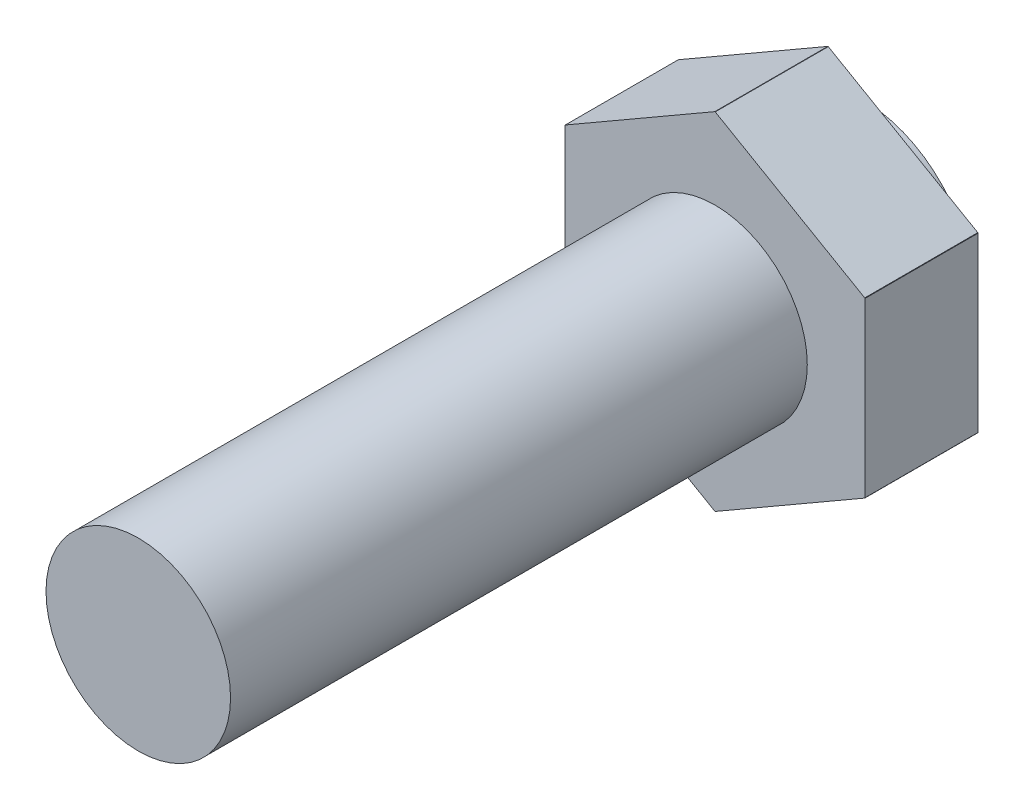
ISO-10303-21;
HEADER;
FILE_DESCRIPTION(('STEP AP214'),'2;1');
FILE_NAME('part.step','',(''),(''),'','','');
FILE_SCHEMA(('AUTOMOTIVE_DESIGN { 1 0 10303 214 1 1 1 1 }'));
ENDSEC;
DATA;
#1=APPLICATION_CONTEXT('core data for automotive mechanical design processes');
#2=APPLICATION_PROTOCOL_DEFINITION('international standard','automotive_design',2000,#1);
#3=PRODUCT_CONTEXT('',#1,'mechanical');
#4=PRODUCT('Part','Part','',(#3));
#5=PRODUCT_RELATED_PRODUCT_CATEGORY('part','',(#4));
#6=PRODUCT_DEFINITION_FORMATION('','',#4);
#7=PRODUCT_DEFINITION_CONTEXT('part definition',#1,'design');
#8=PRODUCT_DEFINITION('design','',#6,#7);
#9=PRODUCT_DEFINITION_SHAPE('','',#8);
#10=(LENGTH_UNIT() NAMED_UNIT(*) SI_UNIT(.MILLI.,.METRE.));
#11=(NAMED_UNIT(*) PLANE_ANGLE_UNIT() SI_UNIT($,.RADIAN.));
#12=(NAMED_UNIT(*) SI_UNIT($,.STERADIAN.) SOLID_ANGLE_UNIT());
#13=UNCERTAINTY_MEASURE_WITH_UNIT(LENGTH_MEASURE(1.E-05),#10,'distance_accuracy_value','');
#14=(GEOMETRIC_REPRESENTATION_CONTEXT(3) GLOBAL_UNCERTAINTY_ASSIGNED_CONTEXT((#13)) GLOBAL_UNIT_ASSIGNED_CONTEXT((#10,
#11,#12)) REPRESENTATION_CONTEXT('',''));
#15=CARTESIAN_POINT('',(0.,0.,0.));
#16=DIRECTION('',(0.,0.,1.));
#17=DIRECTION('',(1.,0.,0.));
#18=AXIS2_PLACEMENT_3D('',#15,#16,#17);
#19=CARTESIAN_POINT('',(-4.,0.,6.4));
#20=DIRECTION('',(0.,0.,-1.));
#21=DIRECTION('',(-1.,0.,0.));
#22=AXIS2_PLACEMENT_3D('',#19,#20,#21);
#23=PLANE('',#22);
#24=CARTESIAN_POINT('',(0.,0.,6.4));
#25=DIRECTION('',(0.,0.,-1.));
#26=DIRECTION('',(-1.,0.,0.));
#27=AXIS2_PLACEMENT_3D('',#24,#25,#26);
#28=CIRCLE('',#27,4.);
#29=CARTESIAN_POINT('',(-4.,0.,6.4));
#30=VERTEX_POINT('',#29);
#31=EDGE_CURVE('E130',#30,#30,#28,.T.);
#32=ORIENTED_EDGE('',*,*,#31,.T.);
#33=EDGE_LOOP('',(#32));
#34=FACE_BOUND('',#33,.T.);
#35=CARTESIAN_POINT('',(0.,0.,6.4));
#36=DIRECTION('',(0.,0.,-1.));
#37=DIRECTION('',(-1.,0.,0.));
#38=AXIS2_PLACEMENT_3D('',#35,#36,#37);
#39=CIRCLE('',#38,7.5);
#40=CARTESIAN_POINT('',(-0.00962965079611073,7.49999381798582,6.4));
#41=VERTEX_POINT('',#40);
#42=CARTESIAN_POINT('',(0.00962965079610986,7.49999381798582,6.4));
#43=VERTEX_POINT('',#42);
#44=EDGE_CURVE('E131',#41,#43,#39,.T.);
#45=ORIENTED_EDGE('',*,*,#44,.F.);
#46=DIRECTION('',(-0.866025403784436,-0.5,0.));
#47=VECTOR('',#46,1.);
#48=CARTESIAN_POINT('',(-6.25,3.89711431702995,6.4));
#49=LINE('',#48,#47);
#50=CARTESIAN_POINT('',(-6.49037034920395,3.75833643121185,6.4));
#51=VERTEX_POINT('',#50);
#52=EDGE_CURVE('E115',#41,#51,#49,.T.);
#53=ORIENTED_EDGE('',*,*,#52,.T.);
#54=CARTESIAN_POINT('',(-6.5,3.74165738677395,6.4));
#55=VERTEX_POINT('',#54);
#56=EDGE_CURVE('E127',#55,#51,#39,.T.);
#57=ORIENTED_EDGE('',*,*,#56,.F.);
#58=DIRECTION('',(0.,-1.,0.));
#59=VECTOR('',#58,1.);
#60=CARTESIAN_POINT('',(-6.5,0.,6.4));
#61=LINE('',#60,#59);
#62=CARTESIAN_POINT('',(-6.5,-3.74165738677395,6.4));
#63=VERTEX_POINT('',#62);
#64=EDGE_CURVE('E121',#55,#63,#61,.T.);
#65=ORIENTED_EDGE('',*,*,#64,.T.);
#66=CARTESIAN_POINT('',(-6.49037034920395,-3.75833643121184,6.4));
#67=VERTEX_POINT('',#66);
#68=EDGE_CURVE('E126',#67,#63,#39,.T.);
#69=ORIENTED_EDGE('',*,*,#68,.F.);
#70=DIRECTION('',(-0.866025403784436,0.5,0.));
#71=VECTOR('',#70,1.);
#72=CARTESIAN_POINT('',(-6.25,-3.89711431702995,6.4));
#73=LINE('',#72,#71);
#74=CARTESIAN_POINT('',(-0.00962965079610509,-7.49999381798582,6.4));
#75=VERTEX_POINT('',#74);
#76=EDGE_CURVE('E247',#75,#67,#73,.T.);
#77=ORIENTED_EDGE('',*,*,#76,.F.);
#78=CARTESIAN_POINT('',(0.00962965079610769,-7.49999381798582,6.4));
#79=VERTEX_POINT('',#78);
#80=EDGE_CURVE('E262',#79,#75,#39,.T.);
#81=ORIENTED_EDGE('',*,*,#80,.F.);
#82=DIRECTION('',(0.866025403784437,0.5,0.));
#83=VECTOR('',#82,1.);
#84=CARTESIAN_POINT('',(0.250000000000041,-7.36121593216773,6.4));
#85=LINE('',#84,#83);
#86=CARTESIAN_POINT('',(6.49037034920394,-3.75833643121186,6.4));
#87=VERTEX_POINT('',#86);
#88=EDGE_CURVE('E239',#79,#87,#85,.T.);
#89=ORIENTED_EDGE('',*,*,#88,.T.);
#90=CARTESIAN_POINT('',(6.5,-3.74165738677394,6.4));
#91=VERTEX_POINT('',#90);
#92=EDGE_CURVE('E264',#91,#87,#39,.T.);
#93=ORIENTED_EDGE('',*,*,#92,.F.);
#94=DIRECTION('',(0.,-1.,0.));
#95=VECTOR('',#94,1.);
#96=CARTESIAN_POINT('',(6.5,0.,6.4));
#97=LINE('',#96,#95);
#98=CARTESIAN_POINT('',(6.5,3.74165738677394,6.4));
#99=VERTEX_POINT('',#98);
#100=EDGE_CURVE('E232',#99,#91,#97,.T.);
#101=ORIENTED_EDGE('',*,*,#100,.F.);
#102=CARTESIAN_POINT('',(6.49037034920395,3.75833643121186,6.4));
#103=VERTEX_POINT('',#102);
#104=EDGE_CURVE('E269',#103,#99,#39,.T.);
#105=ORIENTED_EDGE('',*,*,#104,.F.);
#106=DIRECTION('',(0.866025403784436,-0.5,0.));
#107=VECTOR('',#106,1.);
#108=CARTESIAN_POINT('',(0.250000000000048,7.36121593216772,6.4));
#109=LINE('',#108,#107);
#110=EDGE_CURVE('E225',#43,#103,#109,.T.);
#111=ORIENTED_EDGE('',*,*,#110,.F.);
#112=EDGE_LOOP('',(#45,#53,#57,#65,#69,#77,#81,#89,#93,#101,#105,#111));
#113=FACE_BOUND('',#112,.T.);
#114=ADVANCED_FACE('F14',(#34,#113),#23,.F.);
#115=CARTESIAN_POINT('',(0.,0.,-38.6));
#116=DIRECTION('',(0.,0.,-1.));
#117=DIRECTION('',(-1.,0.,0.));
#118=AXIS2_PLACEMENT_3D('',#115,#116,#117);
#119=CYLINDRICAL_SURFACE('',#118,7.5);
#120=DIRECTION('',(0.,0.,-1.));
#121=VECTOR('',#120,1.);
#122=CARTESIAN_POINT('',(-6.49037034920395,3.75833643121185,-38.6));
#123=LINE('',#122,#121);
#124=CARTESIAN_POINT('',(-6.49037034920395,3.75833643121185,1.5));
#125=VERTEX_POINT('',#124);
#126=EDGE_CURVE('E36',#51,#125,#123,.T.);
#127=ORIENTED_EDGE('',*,*,#126,.T.);
#128=CARTESIAN_POINT('',(0.,0.,1.5));
#129=DIRECTION('',(0.,0.,1.));
#130=DIRECTION('',(1.,0.,0.));
#131=AXIS2_PLACEMENT_3D('',#128,#129,#130);
#132=CIRCLE('',#131,7.5);
#133=CARTESIAN_POINT('',(-6.5,3.74165738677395,1.5));
#134=VERTEX_POINT('',#133);
#135=EDGE_CURVE('E30',#125,#134,#132,.T.);
#136=ORIENTED_EDGE('',*,*,#135,.T.);
#137=DIRECTION('',(0.,0.,-1.));
#138=VECTOR('',#137,1.);
#139=CARTESIAN_POINT('',(-6.5,3.74165738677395,-38.6));
#140=LINE('',#139,#138);
#141=EDGE_CURVE('E252',#134,#55,#140,.F.);
#142=ORIENTED_EDGE('',*,*,#141,.T.);
#143=ORIENTED_EDGE('',*,*,#56,.T.);
#144=EDGE_LOOP('',(#127,#136,#142,#143));
#145=FACE_BOUND('',#144,.T.);
#146=ADVANCED_FACE('F151',(#145),#119,.T.);
#147=DIRECTION('',(0.,0.,-1.));
#148=VECTOR('',#147,1.);
#149=CARTESIAN_POINT('',(-6.5,-3.74165738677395,-38.6));
#150=LINE('',#149,#148);
#151=CARTESIAN_POINT('',(-6.5,-3.74165738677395,1.5));
#152=VERTEX_POINT('',#151);
#153=EDGE_CURVE('E117',#63,#152,#150,.T.);
#154=ORIENTED_EDGE('',*,*,#153,.T.);
#155=CARTESIAN_POINT('',(0.,0.,1.5));
#156=DIRECTION('',(0.,0.,1.));
#157=DIRECTION('',(1.,0.,0.));
#158=AXIS2_PLACEMENT_3D('',#155,#156,#157);
#159=CIRCLE('',#158,7.5);
#160=CARTESIAN_POINT('',(-6.49037034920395,-3.75833643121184,1.5));
#161=VERTEX_POINT('',#160);
#162=EDGE_CURVE('E208',#152,#161,#159,.T.);
#163=ORIENTED_EDGE('',*,*,#162,.T.);
#164=DIRECTION('',(0.,0.,-1.));
#165=VECTOR('',#164,1.);
#166=CARTESIAN_POINT('',(-6.49037034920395,-3.75833643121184,-38.6));
#167=LINE('',#166,#165);
#168=EDGE_CURVE('E249',#67,#161,#167,.T.);
#169=ORIENTED_EDGE('',*,*,#168,.F.);
#170=ORIENTED_EDGE('',*,*,#68,.T.);
#171=EDGE_LOOP('',(#154,#163,#169,#170));
#172=FACE_BOUND('',#171,.T.);
#173=ADVANCED_FACE('F158',(#172),#119,.T.);
#174=DIRECTION('',(0.,0.,-1.));
#175=VECTOR('',#174,1.);
#176=CARTESIAN_POINT('',(0.00962965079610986,7.49999381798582,-38.6));
#177=LINE('',#176,#175);
#178=CARTESIAN_POINT('',(0.00962965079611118,7.49999381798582,1.5));
#179=VERTEX_POINT('',#178);
#180=EDGE_CURVE('E111',#179,#43,#177,.F.);
#181=ORIENTED_EDGE('',*,*,#180,.F.);
#182=CARTESIAN_POINT('',(0.,0.,1.5));
#183=DIRECTION('',(0.,0.,1.));
#184=DIRECTION('',(1.,0.,0.));
#185=AXIS2_PLACEMENT_3D('',#182,#183,#184);
#186=CIRCLE('',#185,7.5);
#187=CARTESIAN_POINT('',(-0.00962965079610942,7.49999381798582,1.5));
#188=VERTEX_POINT('',#187);
#189=EDGE_CURVE('E103',#179,#188,#186,.T.);
#190=ORIENTED_EDGE('',*,*,#189,.T.);
#191=DIRECTION('',(0.,0.,-1.));
#192=VECTOR('',#191,1.);
#193=CARTESIAN_POINT('',(-0.00962965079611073,7.49999381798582,-38.6));
#194=LINE('',#193,#192);
#195=EDGE_CURVE('E110',#188,#41,#194,.F.);
#196=ORIENTED_EDGE('',*,*,#195,.T.);
#197=ORIENTED_EDGE('',*,*,#44,.T.);
#198=EDGE_LOOP('',(#181,#190,#196,#197));
#199=FACE_BOUND('',#198,.T.);
#200=ADVANCED_FACE('F108',(#199),#119,.T.);
#201=DIRECTION('',(0.,0.,-1.));
#202=VECTOR('',#201,1.);
#203=CARTESIAN_POINT('',(-0.00962965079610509,-7.49999381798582,-38.6));
#204=LINE('',#203,#202);
#205=CARTESIAN_POINT('',(-0.00962965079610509,-7.49999381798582,1.5));
#206=VERTEX_POINT('',#205);
#207=EDGE_CURVE('E245',#206,#75,#204,.F.);
#208=ORIENTED_EDGE('',*,*,#207,.F.);
#209=CARTESIAN_POINT('',(0.,0.,1.5));
#210=DIRECTION('',(0.,0.,1.));
#211=DIRECTION('',(1.,0.,0.));
#212=AXIS2_PLACEMENT_3D('',#209,#210,#211);
#213=CIRCLE('',#212,7.5);
#214=CARTESIAN_POINT('',(0.00962965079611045,-7.49999381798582,1.5));
#215=VERTEX_POINT('',#214);
#216=EDGE_CURVE('E218',#206,#215,#213,.T.);
#217=ORIENTED_EDGE('',*,*,#216,.T.);
#218=DIRECTION('',(0.,0.,-1.));
#219=VECTOR('',#218,1.);
#220=CARTESIAN_POINT('',(0.00962965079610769,-7.49999381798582,-38.6));
#221=LINE('',#220,#219);
#222=EDGE_CURVE('E237',#215,#79,#221,.F.);
#223=ORIENTED_EDGE('',*,*,#222,.T.);
#224=ORIENTED_EDGE('',*,*,#80,.T.);
#225=EDGE_LOOP('',(#208,#217,#223,#224));
#226=FACE_BOUND('',#225,.T.);
#227=ADVANCED_FACE('F283',(#226),#119,.T.);
#228=DIRECTION('',(0.,0.,-1.));
#229=VECTOR('',#228,1.);
#230=CARTESIAN_POINT('',(6.49037034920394,-3.75833643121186,-38.6));
#231=LINE('',#230,#229);
#232=CARTESIAN_POINT('',(6.49037034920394,-3.75833643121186,1.5));
#233=VERTEX_POINT('',#232);
#234=EDGE_CURVE('E242',#87,#233,#231,.T.);
#235=ORIENTED_EDGE('',*,*,#234,.T.);
#236=CARTESIAN_POINT('',(0.,0.,1.5));
#237=DIRECTION('',(0.,0.,1.));
#238=DIRECTION('',(1.,0.,0.));
#239=AXIS2_PLACEMENT_3D('',#236,#237,#238);
#240=CIRCLE('',#239,7.5);
#241=CARTESIAN_POINT('',(6.5,-3.74165738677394,1.5));
#242=VERTEX_POINT('',#241);
#243=EDGE_CURVE('E215',#233,#242,#240,.T.);
#244=ORIENTED_EDGE('',*,*,#243,.T.);
#245=DIRECTION('',(0.,0.,-1.));
#246=VECTOR('',#245,1.);
#247=CARTESIAN_POINT('',(6.5,-3.74165738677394,-38.6));
#248=LINE('',#247,#246);
#249=EDGE_CURVE('E234',#91,#242,#248,.T.);
#250=ORIENTED_EDGE('',*,*,#249,.F.);
#251=ORIENTED_EDGE('',*,*,#92,.T.);
#252=EDGE_LOOP('',(#235,#244,#250,#251));
#253=FACE_BOUND('',#252,.T.);
#254=ADVANCED_FACE('F148',(#253),#119,.T.);
#255=DIRECTION('',(0.,0.,-1.));
#256=VECTOR('',#255,1.);
#257=CARTESIAN_POINT('',(6.5,3.74165738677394,-38.6));
#258=LINE('',#257,#256);
#259=CARTESIAN_POINT('',(6.5,3.74165738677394,1.5));
#260=VERTEX_POINT('',#259);
#261=EDGE_CURVE('E230',#260,#99,#258,.F.);
#262=ORIENTED_EDGE('',*,*,#261,.F.);
#263=CARTESIAN_POINT('',(0.,0.,1.5));
#264=DIRECTION('',(0.,0.,1.));
#265=DIRECTION('',(1.,0.,0.));
#266=AXIS2_PLACEMENT_3D('',#263,#264,#265);
#267=CIRCLE('',#266,7.5);
#268=CARTESIAN_POINT('',(6.49037034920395,3.75833643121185,1.5));
#269=VERTEX_POINT('',#268);
#270=EDGE_CURVE('E205',#260,#269,#267,.T.);
#271=ORIENTED_EDGE('',*,*,#270,.T.);
#272=DIRECTION('',(0.,0.,-1.));
#273=VECTOR('',#272,1.);
#274=CARTESIAN_POINT('',(6.49037034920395,3.75833643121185,-38.6));
#275=LINE('',#274,#273);
#276=EDGE_CURVE('E227',#103,#269,#275,.T.);
#277=ORIENTED_EDGE('',*,*,#276,.F.);
#278=ORIENTED_EDGE('',*,*,#104,.T.);
#279=EDGE_LOOP('',(#262,#271,#277,#278));
#280=FACE_BOUND('',#279,.T.);
#281=ADVANCED_FACE('F140',(#280),#119,.T.);
#282=CARTESIAN_POINT('',(0.,0.,31.4));
#283=DIRECTION('',(0.,0.,-1.));
#284=DIRECTION('',(-1.,0.,0.));
#285=AXIS2_PLACEMENT_3D('',#282,#283,#284);
#286=PLANE('',#285);
#287=CARTESIAN_POINT('',(0.,0.,31.4));
#288=DIRECTION('',(0.,0.,-1.));
#289=DIRECTION('',(-1.,0.,0.));
#290=AXIS2_PLACEMENT_3D('',#287,#288,#289);
#291=CIRCLE('',#290,4.);
#292=CARTESIAN_POINT('',(-4.,0.,31.4));
#293=VERTEX_POINT('',#292);
#294=EDGE_CURVE('E23',#293,#293,#291,.T.);
#295=ORIENTED_EDGE('',*,*,#294,.F.);
#296=EDGE_LOOP('',(#295));
#297=FACE_BOUND('',#296,.T.);
#298=ADVANCED_FACE('F16',(#297),#286,.F.);
#299=CARTESIAN_POINT('',(0.,0.,-38.6));
#300=DIRECTION('',(0.,0.,-1.));
#301=DIRECTION('',(-1.,0.,0.));
#302=AXIS2_PLACEMENT_3D('',#299,#300,#301);
#303=CYLINDRICAL_SURFACE('',#302,4.);
#304=ORIENTED_EDGE('',*,*,#31,.F.);
#305=EDGE_LOOP('',(#304));
#306=FACE_BOUND('',#305,.T.);
#307=ORIENTED_EDGE('',*,*,#294,.T.);
#308=EDGE_LOOP('',(#307));
#309=FACE_BOUND('',#308,.T.);
#310=ADVANCED_FACE('F137',(#306,#309),#303,.T.);
#311=CARTESIAN_POINT('',(0.,7.50555349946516,10.));
#312=DIRECTION('',(0.5,0.866025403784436,0.));
#313=DIRECTION('',(0.866025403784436,-0.5,0.));
#314=AXIS2_PLACEMENT_3D('',#311,#312,#313);
#315=PLANE('',#314);
#316=DIRECTION('',(0.866025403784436,-0.5,0.));
#317=VECTOR('',#316,1.);
#318=CARTESIAN_POINT('',(0.,7.50555349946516,1.5));
#319=LINE('',#318,#317);
#320=EDGE_CURVE('E203',#179,#269,#319,.T.);
#321=ORIENTED_EDGE('',*,*,#320,.F.);
#322=ORIENTED_EDGE('',*,*,#180,.T.);
#323=ORIENTED_EDGE('',*,*,#110,.T.);
#324=ORIENTED_EDGE('',*,*,#276,.T.);
#325=EDGE_LOOP('',(#321,#322,#323,#324));
#326=FACE_BOUND('',#325,.T.);
#327=ADVANCED_FACE('F146',(#326),#315,.T.);
#328=CARTESIAN_POINT('',(6.5,3.75277674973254,10.));
#329=DIRECTION('',(1.,0.,0.));
#330=DIRECTION('',(0.,0.,-1.));
#331=AXIS2_PLACEMENT_3D('',#328,#329,#330);
#332=PLANE('',#331);
#333=DIRECTION('',(0.,-1.,0.));
#334=VECTOR('',#333,1.);
#335=CARTESIAN_POINT('',(6.5,3.75277674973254,1.5));
#336=LINE('',#335,#334);
#337=EDGE_CURVE('E213',#260,#242,#336,.T.);
#338=ORIENTED_EDGE('',*,*,#337,.F.);
#339=ORIENTED_EDGE('',*,*,#261,.T.);
#340=ORIENTED_EDGE('',*,*,#100,.T.);
#341=ORIENTED_EDGE('',*,*,#249,.T.);
#342=EDGE_LOOP('',(#338,#339,#340,#341));
#343=FACE_BOUND('',#342,.T.);
#344=ADVANCED_FACE('F177',(#343),#332,.T.);
#345=CARTESIAN_POINT('',(0.,-7.50555349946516,10.));
#346=DIRECTION('',(-0.5,0.866025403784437,0.));
#347=DIRECTION('',(0.866025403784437,0.5,0.));
#348=AXIS2_PLACEMENT_3D('',#345,#346,#347);
#349=PLANE('',#348);
#350=ORIENTED_EDGE('',*,*,#222,.F.);
#351=DIRECTION('',(0.866025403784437,0.5,0.));
#352=VECTOR('',#351,1.);
#353=CARTESIAN_POINT('',(0.,-7.50555349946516,1.5));
#354=LINE('',#353,#352);
#355=EDGE_CURVE('E221',#215,#233,#354,.T.);
#356=ORIENTED_EDGE('',*,*,#355,.T.);
#357=ORIENTED_EDGE('',*,*,#234,.F.);
#358=ORIENTED_EDGE('',*,*,#88,.F.);
#359=EDGE_LOOP('',(#350,#356,#357,#358));
#360=FACE_BOUND('',#359,.T.);
#361=ADVANCED_FACE('F173',(#360),#349,.F.);
#362=CARTESIAN_POINT('',(0.,-7.50555349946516,10.));
#363=DIRECTION('',(-0.5,-0.866025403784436,0.));
#364=DIRECTION('',(-0.866025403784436,0.5,0.));
#365=AXIS2_PLACEMENT_3D('',#362,#363,#364);
#366=PLANE('',#365);
#367=DIRECTION('',(-0.866025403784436,0.5,0.));
#368=VECTOR('',#367,1.);
#369=CARTESIAN_POINT('',(0.,-7.50555349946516,1.5));
#370=LINE('',#369,#368);
#371=EDGE_CURVE('E211',#206,#161,#370,.T.);
#372=ORIENTED_EDGE('',*,*,#371,.F.);
#373=ORIENTED_EDGE('',*,*,#207,.T.);
#374=ORIENTED_EDGE('',*,*,#76,.T.);
#375=ORIENTED_EDGE('',*,*,#168,.T.);
#376=EDGE_LOOP('',(#372,#373,#374,#375));
#377=FACE_BOUND('',#376,.T.);
#378=ADVANCED_FACE('F169',(#377),#366,.T.);
#379=CARTESIAN_POINT('',(-6.5,3.75277674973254,10.));
#380=DIRECTION('',(1.,0.,0.));
#381=DIRECTION('',(0.,-1.,0.));
#382=AXIS2_PLACEMENT_3D('',#379,#380,#381);
#383=PLANE('',#382);
#384=ORIENTED_EDGE('',*,*,#141,.F.);
#385=DIRECTION('',(0.,-1.,0.));
#386=VECTOR('',#385,1.);
#387=CARTESIAN_POINT('',(-6.5,3.75277674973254,1.5));
#388=LINE('',#387,#386);
#389=EDGE_CURVE('E200',#134,#152,#388,.T.);
#390=ORIENTED_EDGE('',*,*,#389,.T.);
#391=ORIENTED_EDGE('',*,*,#153,.F.);
#392=ORIENTED_EDGE('',*,*,#64,.F.);
#393=EDGE_LOOP('',(#384,#390,#391,#392));
#394=FACE_BOUND('',#393,.T.);
#395=ADVANCED_FACE('F166',(#394),#383,.F.);
#396=CARTESIAN_POINT('',(0.,7.50555349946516,10.));
#397=DIRECTION('',(0.5,-0.866025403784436,0.));
#398=DIRECTION('',(-0.866025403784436,-0.5,0.));
#399=AXIS2_PLACEMENT_3D('',#396,#397,#398);
#400=PLANE('',#399);
#401=ORIENTED_EDGE('',*,*,#195,.F.);
#402=DIRECTION('',(-0.866025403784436,-0.5,0.));
#403=VECTOR('',#402,1.);
#404=CARTESIAN_POINT('',(0.,7.50555349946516,1.5));
#405=LINE('',#404,#403);
#406=EDGE_CURVE('E9',#188,#125,#405,.T.);
#407=ORIENTED_EDGE('',*,*,#406,.T.);
#408=ORIENTED_EDGE('',*,*,#126,.F.);
#409=ORIENTED_EDGE('',*,*,#52,.F.);
#410=EDGE_LOOP('',(#401,#407,#408,#409));
#411=FACE_BOUND('',#410,.T.);
#412=ADVANCED_FACE('F114',(#411),#400,.F.);
#413=CARTESIAN_POINT('',(0.,0.,-8.6));
#414=DIRECTION('',(0.,0.,-1.));
#415=DIRECTION('',(-1.,0.,0.));
#416=AXIS2_PLACEMENT_3D('',#413,#414,#415);
#417=CYLINDRICAL_SURFACE('',#416,4.75);
#418=CARTESIAN_POINT('',(0.,0.,1.5));
#419=DIRECTION('',(0.,0.,-1.));
#420=DIRECTION('',(-1.,0.,0.));
#421=AXIS2_PLACEMENT_3D('',#418,#419,#420);
#422=CIRCLE('',#421,4.75);
#423=CARTESIAN_POINT('',(-4.75,0.,1.5));
#424=VERTEX_POINT('',#423);
#425=EDGE_CURVE('E112',#424,#424,#422,.T.);
#426=ORIENTED_EDGE('',*,*,#425,.T.);
#427=EDGE_LOOP('',(#426));
#428=FACE_BOUND('',#427,.T.);
#429=CARTESIAN_POINT('',(0.,0.,0.));
#430=DIRECTION('',(0.,0.,1.));
#431=DIRECTION('',(1.,0.,0.));
#432=AXIS2_PLACEMENT_3D('',#429,#430,#431);
#433=CIRCLE('',#432,4.75);
#434=CARTESIAN_POINT('',(4.75,0.,0.));
#435=VERTEX_POINT('',#434);
#436=EDGE_CURVE('E18',#435,#435,#433,.T.);
#437=ORIENTED_EDGE('',*,*,#436,.T.);
#438=EDGE_LOOP('',(#437));
#439=FACE_BOUND('',#438,.T.);
#440=ADVANCED_FACE('F187',(#428,#439),#417,.T.);
#441=CARTESIAN_POINT('',(0.,11.4999999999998,1.5));
#442=DIRECTION('',(0.,0.,1.));
#443=DIRECTION('',(1.,0.,0.));
#444=AXIS2_PLACEMENT_3D('',#441,#442,#443);
#445=PLANE('',#444);
#446=ORIENTED_EDGE('',*,*,#425,.F.);
#447=EDGE_LOOP('',(#446));
#448=FACE_BOUND('',#447,.T.);
#449=ORIENTED_EDGE('',*,*,#216,.F.);
#450=ORIENTED_EDGE('',*,*,#371,.T.);
#451=ORIENTED_EDGE('',*,*,#162,.F.);
#452=ORIENTED_EDGE('',*,*,#389,.F.);
#453=ORIENTED_EDGE('',*,*,#135,.F.);
#454=ORIENTED_EDGE('',*,*,#406,.F.);
#455=ORIENTED_EDGE('',*,*,#189,.F.);
#456=ORIENTED_EDGE('',*,*,#320,.T.);
#457=ORIENTED_EDGE('',*,*,#270,.F.);
#458=ORIENTED_EDGE('',*,*,#337,.T.);
#459=ORIENTED_EDGE('',*,*,#243,.F.);
#460=ORIENTED_EDGE('',*,*,#355,.F.);
#461=EDGE_LOOP('',(#449,#450,#451,#452,#453,#454,#455,#456,#457,#458,#459,#460));
#462=FACE_BOUND('',#461,.T.);
#463=ADVANCED_FACE('F102',(#448,#462),#445,.F.);
#464=CARTESIAN_POINT('',(-7.5,0.,0.));
#465=DIRECTION('',(0.,0.,1.));
#466=DIRECTION('',(1.,0.,0.));
#467=AXIS2_PLACEMENT_3D('',#464,#465,#466);
#468=PLANE('',#467);
#469=ORIENTED_EDGE('',*,*,#436,.F.);
#470=EDGE_LOOP('',(#469));
#471=FACE_BOUND('',#470,.T.);
#472=ADVANCED_FACE('F162',(#471),#468,.F.);
#473=CLOSED_SHELL('',(#114,#146,#173,#200,#227,#254,#281,#298,#310,#327,#344,#361,#378,#395,
#412,#440,#463,#472));
#474=MANIFOLD_SOLID_BREP('B1',#473);
#475=ADVANCED_BREP_SHAPE_REPRESENTATION('',(#18,#474),#14);
#476=SHAPE_DEFINITION_REPRESENTATION(#9,#475);
ENDSEC;
END-ISO-10303-21;
